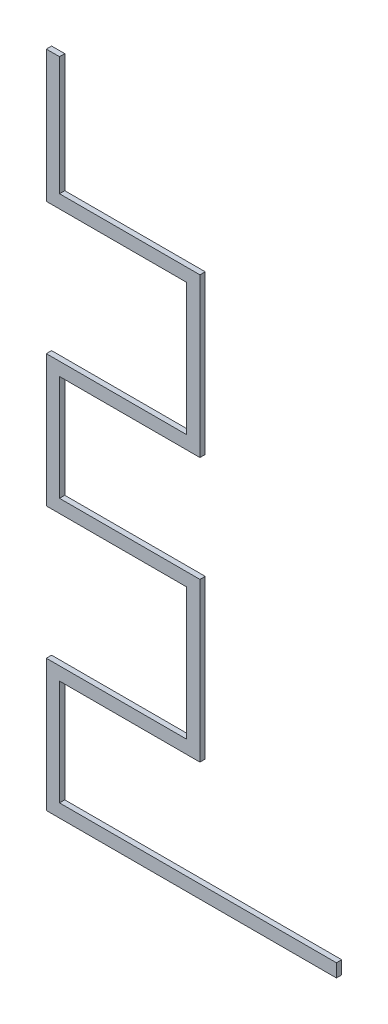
ISO-10303-21;
HEADER;
FILE_DESCRIPTION(('STEP AP214'),'2;1');
FILE_NAME('part.step','',(''),(''),'','','');
FILE_SCHEMA(('AUTOMOTIVE_DESIGN { 1 0 10303 214 1 1 1 1 }'));
ENDSEC;
DATA;
#1=APPLICATION_CONTEXT('core data for automotive mechanical design processes');
#2=APPLICATION_PROTOCOL_DEFINITION('international standard','automotive_design',2000,#1);
#3=PRODUCT_CONTEXT('',#1,'mechanical');
#4=PRODUCT('Part','Part','',(#3));
#5=PRODUCT_RELATED_PRODUCT_CATEGORY('part','',(#4));
#6=PRODUCT_DEFINITION_FORMATION('','',#4);
#7=PRODUCT_DEFINITION_CONTEXT('part definition',#1,'design');
#8=PRODUCT_DEFINITION('design','',#6,#7);
#9=PRODUCT_DEFINITION_SHAPE('','',#8);
#10=(LENGTH_UNIT() NAMED_UNIT(*) SI_UNIT(.MILLI.,.METRE.));
#11=(NAMED_UNIT(*) PLANE_ANGLE_UNIT() SI_UNIT($,.RADIAN.));
#12=(NAMED_UNIT(*) SI_UNIT($,.STERADIAN.) SOLID_ANGLE_UNIT());
#13=UNCERTAINTY_MEASURE_WITH_UNIT(LENGTH_MEASURE(1.E-05),#10,'distance_accuracy_value','');
#14=(GEOMETRIC_REPRESENTATION_CONTEXT(3) GLOBAL_UNCERTAINTY_ASSIGNED_CONTEXT((#13)) GLOBAL_UNIT_ASSIGNED_CONTEXT((#10,
#11,#12)) REPRESENTATION_CONTEXT('',''));
#15=CARTESIAN_POINT('',(0.,0.,0.));
#16=DIRECTION('',(0.,0.,1.));
#17=DIRECTION('',(1.,0.,0.));
#18=AXIS2_PLACEMENT_3D('',#15,#16,#17);
#19=CARTESIAN_POINT('',(-1.00468987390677,-0.331723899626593,0.1));
#20=DIRECTION('',(0.,0.,1.));
#21=DIRECTION('',(1.,0.,0.));
#22=AXIS2_PLACEMENT_3D('',#19,#20,#21);
#23=PLANE('',#22);
#24=DIRECTION('',(0.,1.,0.));
#25=VECTOR('',#24,1.);
#26=CARTESIAN_POINT('',(-2.66251623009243,-2.95934424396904,0.1));
#27=LINE('',#26,#25);
#28=CARTESIAN_POINT('',(-2.66251623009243,-5.45934424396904,0.1));
#29=VERTEX_POINT('',#28);
#30=CARTESIAN_POINT('',(-2.66251623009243,-2.95934424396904,0.1));
#31=VERTEX_POINT('',#30);
#32=EDGE_CURVE('E254',#29,#31,#27,.T.);
#33=ORIENTED_EDGE('',*,*,#32,.F.);
#34=DIRECTION('',(1.,0.,0.));
#35=VECTOR('',#34,1.);
#36=CARTESIAN_POINT('',(-2.66251623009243,-5.45934424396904,0.1));
#37=LINE('',#36,#35);
#38=CARTESIAN_POINT('',(2.83748376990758,-5.45934424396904,0.1));
#39=VERTEX_POINT('',#38);
#40=EDGE_CURVE('E258',#39,#29,#37,.F.);
#41=ORIENTED_EDGE('',*,*,#40,.F.);
#42=DIRECTION('',(0.,1.,0.));
#43=VECTOR('',#42,1.);
#44=CARTESIAN_POINT('',(2.83748376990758,-0.331723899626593,0.1));
#45=LINE('',#44,#43);
#46=CARTESIAN_POINT('',(2.83748376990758,-5.20934424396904,0.1));
#47=VERTEX_POINT('',#46);
#48=EDGE_CURVE('E104',#39,#47,#45,.T.);
#49=ORIENTED_EDGE('',*,*,#48,.T.);
#50=DIRECTION('',(-1.,4.49841222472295E-12,0.));
#51=VECTOR('',#50,1.);
#52=CARTESIAN_POINT('',(2.83748376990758,-5.20934424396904,0.1));
#53=LINE('',#52,#51);
#54=CARTESIAN_POINT('',(-2.41251623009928,-5.20934424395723,0.1));
#55=VERTEX_POINT('',#54);
#56=EDGE_CURVE('E178',#55,#47,#53,.F.);
#57=ORIENTED_EDGE('',*,*,#56,.F.);
#58=DIRECTION('',(0.,1.,0.));
#59=VECTOR('',#58,1.);
#60=CARTESIAN_POINT('',(-2.41251623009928,-5.20934424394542,0.1));
#61=LINE('',#60,#59);
#62=CARTESIAN_POINT('',(-2.41251623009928,-3.20934424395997,0.1));
#63=VERTEX_POINT('',#62);
#64=EDGE_CURVE('E169',#63,#55,#61,.F.);
#65=ORIENTED_EDGE('',*,*,#64,.F.);
#66=DIRECTION('',(1.,0.,0.));
#67=VECTOR('',#66,1.);
#68=CARTESIAN_POINT('',(-2.41251623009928,-3.20934424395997,0.1));
#69=LINE('',#68,#67);
#70=CARTESIAN_POINT('',(0.249999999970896,-3.20934424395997,0.1));
#71=VERTEX_POINT('',#70);
#72=EDGE_CURVE('E185',#71,#63,#69,.F.);
#73=ORIENTED_EDGE('',*,*,#72,.F.);
#74=DIRECTION('',(0.,1.,0.));
#75=VECTOR('',#74,1.);
#76=CARTESIAN_POINT('',(0.249999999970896,-3.20934424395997,0.1));
#77=LINE('',#76,#75);
#78=CARTESIAN_POINT('',(0.249999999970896,-0.209344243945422,0.1));
#79=VERTEX_POINT('',#78);
#80=EDGE_CURVE('E190',#79,#71,#77,.F.);
#81=ORIENTED_EDGE('',*,*,#80,.F.);
#82=DIRECTION('',(-1.,0.,0.));
#83=VECTOR('',#82,1.);
#84=CARTESIAN_POINT('',(0.249999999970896,-0.209344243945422,0.1));
#85=LINE('',#84,#83);
#86=CARTESIAN_POINT('',(-2.41251623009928,-0.209344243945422,0.1));
#87=VERTEX_POINT('',#86);
#88=EDGE_CURVE('E194',#87,#79,#85,.F.);
#89=ORIENTED_EDGE('',*,*,#88,.F.);
#90=DIRECTION('',(0.,1.,0.));
#91=VECTOR('',#90,1.);
#92=CARTESIAN_POINT('',(-2.41251623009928,-0.209344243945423,0.1));
#93=LINE('',#92,#91);
#94=CARTESIAN_POINT('',(-2.41251623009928,1.79065575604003,0.1));
#95=VERTEX_POINT('',#94);
#96=EDGE_CURVE('E198',#95,#87,#93,.F.);
#97=ORIENTED_EDGE('',*,*,#96,.F.);
#98=DIRECTION('',(1.,0.,0.));
#99=VECTOR('',#98,1.);
#100=CARTESIAN_POINT('',(-2.41251623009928,1.79065575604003,0.1));
#101=LINE('',#100,#99);
#102=CARTESIAN_POINT('',(0.249999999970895,1.79065575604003,0.1));
#103=VERTEX_POINT('',#102);
#104=EDGE_CURVE('E202',#103,#95,#101,.F.);
#105=ORIENTED_EDGE('',*,*,#104,.F.);
#106=DIRECTION('',(0.,1.,0.));
#107=VECTOR('',#106,1.);
#108=CARTESIAN_POINT('',(0.249999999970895,1.79065575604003,0.1));
#109=LINE('',#108,#107);
#110=CARTESIAN_POINT('',(0.249999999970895,4.79065575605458,0.1));
#111=VERTEX_POINT('',#110);
#112=EDGE_CURVE('E206',#111,#103,#109,.F.);
#113=ORIENTED_EDGE('',*,*,#112,.F.);
#114=DIRECTION('',(-1.,0.,0.));
#115=VECTOR('',#114,1.);
#116=CARTESIAN_POINT('',(0.249999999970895,4.79065575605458,0.1));
#117=LINE('',#116,#115);
#118=CARTESIAN_POINT('',(-2.41251623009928,4.79065575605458,0.1));
#119=VERTEX_POINT('',#118);
#120=EDGE_CURVE('E210',#119,#111,#117,.F.);
#121=ORIENTED_EDGE('',*,*,#120,.F.);
#122=DIRECTION('',(3.04188772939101E-12,1.,0.));
#123=VECTOR('',#122,1.);
#124=CARTESIAN_POINT('',(-2.41251623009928,4.79065575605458,0.1));
#125=LINE('',#124,#123);
#126=CARTESIAN_POINT('',(-2.41251623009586,7.04065575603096,0.1));
#127=VERTEX_POINT('',#126);
#128=EDGE_CURVE('E214',#127,#119,#125,.F.);
#129=ORIENTED_EDGE('',*,*,#128,.F.);
#130=DIRECTION('',(1.,0.,0.));
#131=VECTOR('',#130,1.);
#132=CARTESIAN_POINT('',(-2.41251623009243,7.04065575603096,0.1));
#133=LINE('',#132,#131);
#134=CARTESIAN_POINT('',(-2.66251623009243,7.04065575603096,0.1));
#135=VERTEX_POINT('',#134);
#136=EDGE_CURVE('E218',#135,#127,#133,.T.);
#137=ORIENTED_EDGE('',*,*,#136,.F.);
#138=DIRECTION('',(0.,-1.,0.));
#139=VECTOR('',#138,1.);
#140=CARTESIAN_POINT('',(-2.66251623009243,7.04065575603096,0.1));
#141=LINE('',#140,#139);
#142=CARTESIAN_POINT('',(-2.66251623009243,4.54065575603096,0.1));
#143=VERTEX_POINT('',#142);
#144=EDGE_CURVE('E222',#143,#135,#141,.F.);
#145=ORIENTED_EDGE('',*,*,#144,.F.);
#146=DIRECTION('',(1.,0.,0.));
#147=VECTOR('',#146,1.);
#148=CARTESIAN_POINT('',(-2.66251623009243,4.54065575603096,0.1));
#149=LINE('',#148,#147);
#150=CARTESIAN_POINT('',(0.,4.54065575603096,0.1));
#151=VERTEX_POINT('',#150);
#152=EDGE_CURVE('E226',#151,#143,#149,.F.);
#153=ORIENTED_EDGE('',*,*,#152,.F.);
#154=DIRECTION('',(0.,-1.,0.));
#155=VECTOR('',#154,1.);
#156=CARTESIAN_POINT('',(0.,4.54065575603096,0.1));
#157=LINE('',#156,#155);
#158=CARTESIAN_POINT('',(0.,2.04065575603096,0.1));
#159=VERTEX_POINT('',#158);
#160=EDGE_CURVE('E230',#159,#151,#157,.F.);
#161=ORIENTED_EDGE('',*,*,#160,.F.);
#162=DIRECTION('',(-1.,0.,0.));
#163=VECTOR('',#162,1.);
#164=CARTESIAN_POINT('',(0.,2.04065575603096,0.1));
#165=LINE('',#164,#163);
#166=CARTESIAN_POINT('',(-2.66251623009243,2.04065575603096,0.1));
#167=VERTEX_POINT('',#166);
#168=EDGE_CURVE('E234',#167,#159,#165,.F.);
#169=ORIENTED_EDGE('',*,*,#168,.F.);
#170=DIRECTION('',(0.,1.,0.));
#171=VECTOR('',#170,1.);
#172=CARTESIAN_POINT('',(-2.66251623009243,2.04065575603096,0.1));
#173=LINE('',#172,#171);
#174=CARTESIAN_POINT('',(-2.66251623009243,-0.45934424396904,0.1));
#175=VERTEX_POINT('',#174);
#176=EDGE_CURVE('E238',#175,#167,#173,.T.);
#177=ORIENTED_EDGE('',*,*,#176,.F.);
#178=DIRECTION('',(1.,0.,0.));
#179=VECTOR('',#178,1.);
#180=CARTESIAN_POINT('',(-2.66251623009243,-0.45934424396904,0.1));
#181=LINE('',#180,#179);
#182=CARTESIAN_POINT('',(0.,-0.459344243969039,0.1));
#183=VERTEX_POINT('',#182);
#184=EDGE_CURVE('E242',#183,#175,#181,.F.);
#185=ORIENTED_EDGE('',*,*,#184,.F.);
#186=DIRECTION('',(0.,-1.,0.));
#187=VECTOR('',#186,1.);
#188=CARTESIAN_POINT('',(0.,-0.459344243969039,0.1));
#189=LINE('',#188,#187);
#190=CARTESIAN_POINT('',(0.,-2.95934424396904,0.1));
#191=VERTEX_POINT('',#190);
#192=EDGE_CURVE('E246',#191,#183,#189,.F.);
#193=ORIENTED_EDGE('',*,*,#192,.F.);
#194=DIRECTION('',(-1.,0.,0.));
#195=VECTOR('',#194,1.);
#196=CARTESIAN_POINT('',(0.,-2.95934424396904,0.1));
#197=LINE('',#196,#195);
#198=EDGE_CURVE('E250',#31,#191,#197,.F.);
#199=ORIENTED_EDGE('',*,*,#198,.F.);
#200=EDGE_LOOP('',(#33,#41,#49,#57,#65,#73,#81,#89,#97,#105,#113,#121,#129,#137,#145,#153,#161,
#169,#177,#185,#193,#199));
#201=FACE_BOUND('',#200,.T.);
#202=ADVANCED_FACE('F15',(#201),#23,.T.);
#203=CARTESIAN_POINT('',(2.83748376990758,-5.20934424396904,0.));
#204=DIRECTION('',(4.49841222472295E-12,1.,0.));
#205=DIRECTION('',(-1.,4.49841222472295E-12,0.));
#206=AXIS2_PLACEMENT_3D('',#203,#204,#205);
#207=PLANE('',#206);
#208=ORIENTED_EDGE('',*,*,#56,.T.);
#209=DIRECTION('',(0.,0.,-1.));
#210=VECTOR('',#209,1.);
#211=CARTESIAN_POINT('',(2.83748376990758,-5.20934424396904,0.));
#212=LINE('',#211,#210);
#213=CARTESIAN_POINT('',(2.83748376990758,-5.20934424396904,0.));
#214=VERTEX_POINT('',#213);
#215=EDGE_CURVE('E262',#214,#47,#212,.F.);
#216=ORIENTED_EDGE('',*,*,#215,.F.);
#217=DIRECTION('',(1.,0.,0.));
#218=VECTOR('',#217,1.);
#219=CARTESIAN_POINT('',(-1.00468987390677,-5.20934424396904,0.));
#220=LINE('',#219,#218);
#221=CARTESIAN_POINT('',(-2.41251623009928,-5.20934424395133,0.));
#222=VERTEX_POINT('',#221);
#223=EDGE_CURVE('E19',#214,#222,#220,.F.);
#224=ORIENTED_EDGE('',*,*,#223,.T.);
#225=DIRECTION('',(0.,0.,-1.));
#226=VECTOR('',#225,1.);
#227=CARTESIAN_POINT('',(-2.41251623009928,-5.20934424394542,0.));
#228=LINE('',#227,#226);
#229=EDGE_CURVE('E174',#55,#222,#228,.T.);
#230=ORIENTED_EDGE('',*,*,#229,.F.);
#231=EDGE_LOOP('',(#208,#216,#224,#230));
#232=FACE_BOUND('',#231,.T.);
#233=ADVANCED_FACE('F184',(#232),#207,.T.);
#234=CARTESIAN_POINT('',(-2.41251623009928,-5.20934424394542,0.));
#235=DIRECTION('',(1.,0.,0.));
#236=DIRECTION('',(0.,0.,-1.));
#237=AXIS2_PLACEMENT_3D('',#234,#235,#236);
#238=PLANE('',#237);
#239=ORIENTED_EDGE('',*,*,#64,.T.);
#240=ORIENTED_EDGE('',*,*,#229,.T.);
#241=DIRECTION('',(0.,1.,0.));
#242=VECTOR('',#241,1.);
#243=CARTESIAN_POINT('',(-2.41251623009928,-0.331723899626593,0.));
#244=LINE('',#243,#242);
#245=CARTESIAN_POINT('',(-2.41251623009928,-3.20934424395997,0.));
#246=VERTEX_POINT('',#245);
#247=EDGE_CURVE('E321',#222,#246,#244,.T.);
#248=ORIENTED_EDGE('',*,*,#247,.T.);
#249=DIRECTION('',(0.,0.,-1.));
#250=VECTOR('',#249,1.);
#251=CARTESIAN_POINT('',(-2.41251623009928,-3.20934424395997,0.));
#252=LINE('',#251,#250);
#253=EDGE_CURVE('E175',#63,#246,#252,.T.);
#254=ORIENTED_EDGE('',*,*,#253,.F.);
#255=EDGE_LOOP('',(#239,#240,#248,#254));
#256=FACE_BOUND('',#255,.T.);
#257=ADVANCED_FACE('F171',(#256),#238,.T.);
#258=CARTESIAN_POINT('',(-2.41251623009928,-3.20934424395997,0.));
#259=DIRECTION('',(0.,-1.,0.));
#260=DIRECTION('',(0.,0.,-1.));
#261=AXIS2_PLACEMENT_3D('',#258,#259,#260);
#262=PLANE('',#261);
#263=ORIENTED_EDGE('',*,*,#72,.T.);
#264=ORIENTED_EDGE('',*,*,#253,.T.);
#265=DIRECTION('',(1.,0.,0.));
#266=VECTOR('',#265,1.);
#267=CARTESIAN_POINT('',(-1.00468987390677,-3.20934424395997,0.));
#268=LINE('',#267,#266);
#269=CARTESIAN_POINT('',(0.249999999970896,-3.20934424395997,0.));
#270=VERTEX_POINT('',#269);
#271=EDGE_CURVE('E319',#246,#270,#268,.T.);
#272=ORIENTED_EDGE('',*,*,#271,.T.);
#273=DIRECTION('',(0.,0.,1.));
#274=VECTOR('',#273,1.);
#275=CARTESIAN_POINT('',(0.249999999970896,-3.20934424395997,0.));
#276=LINE('',#275,#274);
#277=EDGE_CURVE('E192',#71,#270,#276,.F.);
#278=ORIENTED_EDGE('',*,*,#277,.F.);
#279=EDGE_LOOP('',(#263,#264,#272,#278));
#280=FACE_BOUND('',#279,.T.);
#281=ADVANCED_FACE('F328',(#280),#262,.T.);
#282=CARTESIAN_POINT('',(0.249999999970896,-3.20934424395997,0.));
#283=DIRECTION('',(1.,0.,0.));
#284=DIRECTION('',(0.,1.,0.));
#285=AXIS2_PLACEMENT_3D('',#282,#283,#284);
#286=PLANE('',#285);
#287=ORIENTED_EDGE('',*,*,#80,.T.);
#288=ORIENTED_EDGE('',*,*,#277,.T.);
#289=DIRECTION('',(0.,1.,0.));
#290=VECTOR('',#289,1.);
#291=CARTESIAN_POINT('',(0.249999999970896,-0.331723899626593,0.));
#292=LINE('',#291,#290);
#293=CARTESIAN_POINT('',(0.249999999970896,-0.209344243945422,0.));
#294=VERTEX_POINT('',#293);
#295=EDGE_CURVE('E316',#270,#294,#292,.T.);
#296=ORIENTED_EDGE('',*,*,#295,.T.);
#297=DIRECTION('',(0.,0.,1.));
#298=VECTOR('',#297,1.);
#299=CARTESIAN_POINT('',(0.249999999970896,-0.209344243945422,0.));
#300=LINE('',#299,#298);
#301=EDGE_CURVE('E196',#79,#294,#300,.F.);
#302=ORIENTED_EDGE('',*,*,#301,.F.);
#303=EDGE_LOOP('',(#287,#288,#296,#302));
#304=FACE_BOUND('',#303,.T.);
#305=ADVANCED_FACE('F335',(#304),#286,.T.);
#306=CARTESIAN_POINT('',(0.249999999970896,-0.209344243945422,0.));
#307=DIRECTION('',(0.,1.,0.));
#308=DIRECTION('',(-1.,0.,0.));
#309=AXIS2_PLACEMENT_3D('',#306,#307,#308);
#310=PLANE('',#309);
#311=ORIENTED_EDGE('',*,*,#88,.T.);
#312=ORIENTED_EDGE('',*,*,#301,.T.);
#313=DIRECTION('',(1.,0.,0.));
#314=VECTOR('',#313,1.);
#315=CARTESIAN_POINT('',(-1.00468987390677,-0.209344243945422,0.));
#316=LINE('',#315,#314);
#317=CARTESIAN_POINT('',(-2.41251623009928,-0.209344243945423,0.));
#318=VERTEX_POINT('',#317);
#319=EDGE_CURVE('E313',#294,#318,#316,.F.);
#320=ORIENTED_EDGE('',*,*,#319,.T.);
#321=DIRECTION('',(0.,0.,-1.));
#322=VECTOR('',#321,1.);
#323=CARTESIAN_POINT('',(-2.41251623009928,-0.209344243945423,0.));
#324=LINE('',#323,#322);
#325=EDGE_CURVE('E200',#87,#318,#324,.T.);
#326=ORIENTED_EDGE('',*,*,#325,.F.);
#327=EDGE_LOOP('',(#311,#312,#320,#326));
#328=FACE_BOUND('',#327,.T.);
#329=ADVANCED_FACE('F337',(#328),#310,.T.);
#330=CARTESIAN_POINT('',(-2.41251623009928,-0.209344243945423,0.));
#331=DIRECTION('',(1.,0.,0.));
#332=DIRECTION('',(0.,0.,-1.));
#333=AXIS2_PLACEMENT_3D('',#330,#331,#332);
#334=PLANE('',#333);
#335=ORIENTED_EDGE('',*,*,#96,.T.);
#336=ORIENTED_EDGE('',*,*,#325,.T.);
#337=DIRECTION('',(0.,1.,0.));
#338=VECTOR('',#337,1.);
#339=CARTESIAN_POINT('',(-2.41251623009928,-0.331723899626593,0.));
#340=LINE('',#339,#338);
#341=CARTESIAN_POINT('',(-2.41251623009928,1.79065575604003,0.));
#342=VERTEX_POINT('',#341);
#343=EDGE_CURVE('E310',#318,#342,#340,.T.);
#344=ORIENTED_EDGE('',*,*,#343,.T.);
#345=DIRECTION('',(0.,0.,-1.));
#346=VECTOR('',#345,1.);
#347=CARTESIAN_POINT('',(-2.41251623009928,1.79065575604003,0.));
#348=LINE('',#347,#346);
#349=EDGE_CURVE('E204',#95,#342,#348,.T.);
#350=ORIENTED_EDGE('',*,*,#349,.F.);
#351=EDGE_LOOP('',(#335,#336,#344,#350));
#352=FACE_BOUND('',#351,.T.);
#353=ADVANCED_FACE('F343',(#352),#334,.T.);
#354=CARTESIAN_POINT('',(-2.41251623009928,1.79065575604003,0.));
#355=DIRECTION('',(0.,-1.,0.));
#356=DIRECTION('',(0.,0.,-1.));
#357=AXIS2_PLACEMENT_3D('',#354,#355,#356);
#358=PLANE('',#357);
#359=ORIENTED_EDGE('',*,*,#104,.T.);
#360=ORIENTED_EDGE('',*,*,#349,.T.);
#361=DIRECTION('',(1.,0.,0.));
#362=VECTOR('',#361,1.);
#363=CARTESIAN_POINT('',(-1.00468987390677,1.79065575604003,0.));
#364=LINE('',#363,#362);
#365=CARTESIAN_POINT('',(0.249999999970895,1.79065575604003,0.));
#366=VERTEX_POINT('',#365);
#367=EDGE_CURVE('E307',#342,#366,#364,.T.);
#368=ORIENTED_EDGE('',*,*,#367,.T.);
#369=DIRECTION('',(0.,0.,1.));
#370=VECTOR('',#369,1.);
#371=CARTESIAN_POINT('',(0.249999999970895,1.79065575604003,0.));
#372=LINE('',#371,#370);
#373=EDGE_CURVE('E208',#103,#366,#372,.F.);
#374=ORIENTED_EDGE('',*,*,#373,.F.);
#375=EDGE_LOOP('',(#359,#360,#368,#374));
#376=FACE_BOUND('',#375,.T.);
#377=ADVANCED_FACE('F350',(#376),#358,.T.);
#378=CARTESIAN_POINT('',(0.249999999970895,1.79065575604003,0.));
#379=DIRECTION('',(1.,0.,0.));
#380=DIRECTION('',(0.,1.,0.));
#381=AXIS2_PLACEMENT_3D('',#378,#379,#380);
#382=PLANE('',#381);
#383=ORIENTED_EDGE('',*,*,#112,.T.);
#384=ORIENTED_EDGE('',*,*,#373,.T.);
#385=DIRECTION('',(0.,1.,0.));
#386=VECTOR('',#385,1.);
#387=CARTESIAN_POINT('',(0.249999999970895,-0.331723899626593,0.));
#388=LINE('',#387,#386);
#389=CARTESIAN_POINT('',(0.249999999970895,4.79065575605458,0.));
#390=VERTEX_POINT('',#389);
#391=EDGE_CURVE('E304',#366,#390,#388,.T.);
#392=ORIENTED_EDGE('',*,*,#391,.T.);
#393=DIRECTION('',(0.,0.,1.));
#394=VECTOR('',#393,1.);
#395=CARTESIAN_POINT('',(0.249999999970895,4.79065575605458,0.));
#396=LINE('',#395,#394);
#397=EDGE_CURVE('E212',#111,#390,#396,.F.);
#398=ORIENTED_EDGE('',*,*,#397,.F.);
#399=EDGE_LOOP('',(#383,#384,#392,#398));
#400=FACE_BOUND('',#399,.T.);
#401=ADVANCED_FACE('F352',(#400),#382,.T.);
#402=CARTESIAN_POINT('',(0.249999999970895,4.79065575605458,0.));
#403=DIRECTION('',(0.,1.,0.));
#404=DIRECTION('',(-1.,0.,0.));
#405=AXIS2_PLACEMENT_3D('',#402,#403,#404);
#406=PLANE('',#405);
#407=ORIENTED_EDGE('',*,*,#120,.T.);
#408=ORIENTED_EDGE('',*,*,#397,.T.);
#409=DIRECTION('',(1.,0.,0.));
#410=VECTOR('',#409,1.);
#411=CARTESIAN_POINT('',(-1.00468987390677,4.79065575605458,0.));
#412=LINE('',#411,#410);
#413=CARTESIAN_POINT('',(-2.41251623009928,4.79065575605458,0.));
#414=VERTEX_POINT('',#413);
#415=EDGE_CURVE('E301',#390,#414,#412,.F.);
#416=ORIENTED_EDGE('',*,*,#415,.T.);
#417=DIRECTION('',(0.,0.,1.));
#418=VECTOR('',#417,1.);
#419=CARTESIAN_POINT('',(-2.41251623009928,4.79065575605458,0.));
#420=LINE('',#419,#418);
#421=EDGE_CURVE('E216',#119,#414,#420,.F.);
#422=ORIENTED_EDGE('',*,*,#421,.F.);
#423=EDGE_LOOP('',(#407,#408,#416,#422));
#424=FACE_BOUND('',#423,.T.);
#425=ADVANCED_FACE('F358',(#424),#406,.T.);
#426=CARTESIAN_POINT('',(-2.41251623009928,4.79065575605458,0.));
#427=DIRECTION('',(1.,-3.04188772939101E-12,0.));
#428=DIRECTION('',(3.04188772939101E-12,1.,0.));
#429=AXIS2_PLACEMENT_3D('',#426,#427,#428);
#430=PLANE('',#429);
#431=ORIENTED_EDGE('',*,*,#128,.T.);
#432=ORIENTED_EDGE('',*,*,#421,.T.);
#433=DIRECTION('',(0.,1.,0.));
#434=VECTOR('',#433,1.);
#435=CARTESIAN_POINT('',(-2.41251623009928,-0.331723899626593,0.));
#436=LINE('',#435,#434);
#437=CARTESIAN_POINT('',(-2.41251623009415,7.04065575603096,0.));
#438=VERTEX_POINT('',#437);
#439=EDGE_CURVE('E298',#414,#438,#436,.T.);
#440=ORIENTED_EDGE('',*,*,#439,.T.);
#441=DIRECTION('',(0.,0.,1.));
#442=VECTOR('',#441,1.);
#443=CARTESIAN_POINT('',(-2.41251623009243,7.04065575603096,0.));
#444=LINE('',#443,#442);
#445=EDGE_CURVE('E220',#127,#438,#444,.F.);
#446=ORIENTED_EDGE('',*,*,#445,.F.);
#447=EDGE_LOOP('',(#431,#432,#440,#446));
#448=FACE_BOUND('',#447,.T.);
#449=ADVANCED_FACE('F365',(#448),#430,.T.);
#450=CARTESIAN_POINT('',(-2.41251623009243,7.04065575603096,0.));
#451=DIRECTION('',(0.,1.,0.));
#452=DIRECTION('',(0.,0.,1.));
#453=AXIS2_PLACEMENT_3D('',#450,#451,#452);
#454=PLANE('',#453);
#455=ORIENTED_EDGE('',*,*,#136,.T.);
#456=ORIENTED_EDGE('',*,*,#445,.T.);
#457=DIRECTION('',(1.,0.,0.));
#458=VECTOR('',#457,1.);
#459=CARTESIAN_POINT('',(-1.00468987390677,7.04065575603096,0.));
#460=LINE('',#459,#458);
#461=CARTESIAN_POINT('',(-2.66251623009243,7.04065575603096,0.));
#462=VERTEX_POINT('',#461);
#463=EDGE_CURVE('E295',#438,#462,#460,.F.);
#464=ORIENTED_EDGE('',*,*,#463,.T.);
#465=DIRECTION('',(0.,0.,1.));
#466=VECTOR('',#465,1.);
#467=CARTESIAN_POINT('',(-2.66251623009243,7.04065575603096,0.));
#468=LINE('',#467,#466);
#469=EDGE_CURVE('E224',#135,#462,#468,.F.);
#470=ORIENTED_EDGE('',*,*,#469,.F.);
#471=EDGE_LOOP('',(#455,#456,#464,#470));
#472=FACE_BOUND('',#471,.T.);
#473=ADVANCED_FACE('F367',(#472),#454,.T.);
#474=CARTESIAN_POINT('',(-2.66251623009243,7.04065575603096,0.));
#475=DIRECTION('',(-1.,0.,0.));
#476=DIRECTION('',(0.,-1.,0.));
#477=AXIS2_PLACEMENT_3D('',#474,#475,#476);
#478=PLANE('',#477);
#479=ORIENTED_EDGE('',*,*,#144,.T.);
#480=ORIENTED_EDGE('',*,*,#469,.T.);
#481=DIRECTION('',(0.,1.,0.));
#482=VECTOR('',#481,1.);
#483=CARTESIAN_POINT('',(-2.66251623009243,-0.331723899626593,0.));
#484=LINE('',#483,#482);
#485=CARTESIAN_POINT('',(-2.66251623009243,4.54065575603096,0.));
#486=VERTEX_POINT('',#485);
#487=EDGE_CURVE('E292',#462,#486,#484,.F.);
#488=ORIENTED_EDGE('',*,*,#487,.T.);
#489=DIRECTION('',(0.,0.,1.));
#490=VECTOR('',#489,1.);
#491=CARTESIAN_POINT('',(-2.66251623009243,4.54065575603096,0.));
#492=LINE('',#491,#490);
#493=EDGE_CURVE('E228',#143,#486,#492,.F.);
#494=ORIENTED_EDGE('',*,*,#493,.F.);
#495=EDGE_LOOP('',(#479,#480,#488,#494));
#496=FACE_BOUND('',#495,.T.);
#497=ADVANCED_FACE('F373',(#496),#478,.T.);
#498=CARTESIAN_POINT('',(-2.66251623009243,4.54065575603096,0.));
#499=DIRECTION('',(0.,-1.,0.));
#500=DIRECTION('',(1.,0.,0.));
#501=AXIS2_PLACEMENT_3D('',#498,#499,#500);
#502=PLANE('',#501);
#503=ORIENTED_EDGE('',*,*,#152,.T.);
#504=ORIENTED_EDGE('',*,*,#493,.T.);
#505=DIRECTION('',(1.,0.,0.));
#506=VECTOR('',#505,1.);
#507=CARTESIAN_POINT('',(-1.00468987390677,4.54065575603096,0.));
#508=LINE('',#507,#506);
#509=CARTESIAN_POINT('',(0.,4.54065575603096,0.));
#510=VERTEX_POINT('',#509);
#511=EDGE_CURVE('E289',#486,#510,#508,.T.);
#512=ORIENTED_EDGE('',*,*,#511,.T.);
#513=DIRECTION('',(0.,0.,1.));
#514=VECTOR('',#513,1.);
#515=CARTESIAN_POINT('',(0.,4.54065575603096,0.));
#516=LINE('',#515,#514);
#517=EDGE_CURVE('E232',#151,#510,#516,.F.);
#518=ORIENTED_EDGE('',*,*,#517,.F.);
#519=EDGE_LOOP('',(#503,#504,#512,#518));
#520=FACE_BOUND('',#519,.T.);
#521=ADVANCED_FACE('F380',(#520),#502,.T.);
#522=CARTESIAN_POINT('',(0.,4.54065575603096,0.));
#523=DIRECTION('',(-1.,0.,0.));
#524=DIRECTION('',(0.,-1.,0.));
#525=AXIS2_PLACEMENT_3D('',#522,#523,#524);
#526=PLANE('',#525);
#527=ORIENTED_EDGE('',*,*,#160,.T.);
#528=ORIENTED_EDGE('',*,*,#517,.T.);
#529=DIRECTION('',(0.,1.,0.));
#530=VECTOR('',#529,1.);
#531=CARTESIAN_POINT('',(0.,-0.331723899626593,0.));
#532=LINE('',#531,#530);
#533=CARTESIAN_POINT('',(0.,2.04065575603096,0.));
#534=VERTEX_POINT('',#533);
#535=EDGE_CURVE('E286',#510,#534,#532,.F.);
#536=ORIENTED_EDGE('',*,*,#535,.T.);
#537=DIRECTION('',(0.,0.,1.));
#538=VECTOR('',#537,1.);
#539=CARTESIAN_POINT('',(0.,2.04065575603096,0.));
#540=LINE('',#539,#538);
#541=EDGE_CURVE('E236',#159,#534,#540,.F.);
#542=ORIENTED_EDGE('',*,*,#541,.F.);
#543=EDGE_LOOP('',(#527,#528,#536,#542));
#544=FACE_BOUND('',#543,.T.);
#545=ADVANCED_FACE('F382',(#544),#526,.T.);
#546=CARTESIAN_POINT('',(0.,2.04065575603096,0.));
#547=DIRECTION('',(0.,1.,0.));
#548=DIRECTION('',(-1.,0.,0.));
#549=AXIS2_PLACEMENT_3D('',#546,#547,#548);
#550=PLANE('',#549);
#551=ORIENTED_EDGE('',*,*,#168,.T.);
#552=ORIENTED_EDGE('',*,*,#541,.T.);
#553=DIRECTION('',(1.,0.,0.));
#554=VECTOR('',#553,1.);
#555=CARTESIAN_POINT('',(-1.00468987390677,2.04065575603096,0.));
#556=LINE('',#555,#554);
#557=CARTESIAN_POINT('',(-2.66251623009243,2.04065575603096,0.));
#558=VERTEX_POINT('',#557);
#559=EDGE_CURVE('E283',#534,#558,#556,.F.);
#560=ORIENTED_EDGE('',*,*,#559,.T.);
#561=DIRECTION('',(0.,0.,1.));
#562=VECTOR('',#561,1.);
#563=CARTESIAN_POINT('',(-2.66251623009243,2.04065575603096,0.));
#564=LINE('',#563,#562);
#565=EDGE_CURVE('E240',#167,#558,#564,.F.);
#566=ORIENTED_EDGE('',*,*,#565,.F.);
#567=EDGE_LOOP('',(#551,#552,#560,#566));
#568=FACE_BOUND('',#567,.T.);
#569=ADVANCED_FACE('F388',(#568),#550,.T.);
#570=CARTESIAN_POINT('',(-2.66251623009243,2.04065575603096,0.));
#571=DIRECTION('',(-1.,0.,0.));
#572=DIRECTION('',(0.,0.,1.));
#573=AXIS2_PLACEMENT_3D('',#570,#571,#572);
#574=PLANE('',#573);
#575=ORIENTED_EDGE('',*,*,#176,.T.);
#576=ORIENTED_EDGE('',*,*,#565,.T.);
#577=DIRECTION('',(0.,1.,0.));
#578=VECTOR('',#577,1.);
#579=CARTESIAN_POINT('',(-2.66251623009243,-0.331723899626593,0.));
#580=LINE('',#579,#578);
#581=CARTESIAN_POINT('',(-2.66251623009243,-0.45934424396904,0.));
#582=VERTEX_POINT('',#581);
#583=EDGE_CURVE('E280',#558,#582,#580,.F.);
#584=ORIENTED_EDGE('',*,*,#583,.T.);
#585=DIRECTION('',(0.,0.,1.));
#586=VECTOR('',#585,1.);
#587=CARTESIAN_POINT('',(-2.66251623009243,-0.45934424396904,0.));
#588=LINE('',#587,#586);
#589=EDGE_CURVE('E244',#175,#582,#588,.F.);
#590=ORIENTED_EDGE('',*,*,#589,.F.);
#591=EDGE_LOOP('',(#575,#576,#584,#590));
#592=FACE_BOUND('',#591,.T.);
#593=ADVANCED_FACE('F395',(#592),#574,.T.);
#594=CARTESIAN_POINT('',(-2.66251623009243,-0.45934424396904,0.));
#595=DIRECTION('',(0.,-1.,0.));
#596=DIRECTION('',(1.,0.,0.));
#597=AXIS2_PLACEMENT_3D('',#594,#595,#596);
#598=PLANE('',#597);
#599=ORIENTED_EDGE('',*,*,#184,.T.);
#600=ORIENTED_EDGE('',*,*,#589,.T.);
#601=DIRECTION('',(1.,0.,0.));
#602=VECTOR('',#601,1.);
#603=CARTESIAN_POINT('',(-1.00468987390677,-0.45934424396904,0.));
#604=LINE('',#603,#602);
#605=CARTESIAN_POINT('',(0.,-0.459344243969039,0.));
#606=VERTEX_POINT('',#605);
#607=EDGE_CURVE('E277',#582,#606,#604,.T.);
#608=ORIENTED_EDGE('',*,*,#607,.T.);
#609=DIRECTION('',(0.,0.,1.));
#610=VECTOR('',#609,1.);
#611=CARTESIAN_POINT('',(0.,-0.459344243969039,0.));
#612=LINE('',#611,#610);
#613=EDGE_CURVE('E248',#183,#606,#612,.F.);
#614=ORIENTED_EDGE('',*,*,#613,.F.);
#615=EDGE_LOOP('',(#599,#600,#608,#614));
#616=FACE_BOUND('',#615,.T.);
#617=ADVANCED_FACE('F397',(#616),#598,.T.);
#618=CARTESIAN_POINT('',(0.,-0.459344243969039,0.));
#619=DIRECTION('',(-1.,0.,0.));
#620=DIRECTION('',(0.,-1.,0.));
#621=AXIS2_PLACEMENT_3D('',#618,#619,#620);
#622=PLANE('',#621);
#623=ORIENTED_EDGE('',*,*,#192,.T.);
#624=ORIENTED_EDGE('',*,*,#613,.T.);
#625=DIRECTION('',(0.,1.,0.));
#626=VECTOR('',#625,1.);
#627=CARTESIAN_POINT('',(0.,-0.331723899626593,0.));
#628=LINE('',#627,#626);
#629=CARTESIAN_POINT('',(0.,-2.95934424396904,0.));
#630=VERTEX_POINT('',#629);
#631=EDGE_CURVE('E274',#606,#630,#628,.F.);
#632=ORIENTED_EDGE('',*,*,#631,.T.);
#633=DIRECTION('',(0.,0.,1.));
#634=VECTOR('',#633,1.);
#635=CARTESIAN_POINT('',(0.,-2.95934424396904,0.));
#636=LINE('',#635,#634);
#637=EDGE_CURVE('E252',#191,#630,#636,.F.);
#638=ORIENTED_EDGE('',*,*,#637,.F.);
#639=EDGE_LOOP('',(#623,#624,#632,#638));
#640=FACE_BOUND('',#639,.T.);
#641=ADVANCED_FACE('F403',(#640),#622,.T.);
#642=CARTESIAN_POINT('',(0.,-2.95934424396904,0.));
#643=DIRECTION('',(0.,1.,0.));
#644=DIRECTION('',(-1.,0.,0.));
#645=AXIS2_PLACEMENT_3D('',#642,#643,#644);
#646=PLANE('',#645);
#647=ORIENTED_EDGE('',*,*,#198,.T.);
#648=ORIENTED_EDGE('',*,*,#637,.T.);
#649=DIRECTION('',(1.,0.,0.));
#650=VECTOR('',#649,1.);
#651=CARTESIAN_POINT('',(-1.00468987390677,-2.95934424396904,0.));
#652=LINE('',#651,#650);
#653=CARTESIAN_POINT('',(-2.66251623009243,-2.95934424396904,0.));
#654=VERTEX_POINT('',#653);
#655=EDGE_CURVE('E271',#630,#654,#652,.F.);
#656=ORIENTED_EDGE('',*,*,#655,.T.);
#657=DIRECTION('',(0.,0.,1.));
#658=VECTOR('',#657,1.);
#659=CARTESIAN_POINT('',(-2.66251623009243,-2.95934424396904,0.));
#660=LINE('',#659,#658);
#661=EDGE_CURVE('E256',#31,#654,#660,.F.);
#662=ORIENTED_EDGE('',*,*,#661,.F.);
#663=EDGE_LOOP('',(#647,#648,#656,#662));
#664=FACE_BOUND('',#663,.T.);
#665=ADVANCED_FACE('F408',(#664),#646,.T.);
#666=CARTESIAN_POINT('',(-2.66251623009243,-2.95934424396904,0.));
#667=DIRECTION('',(-1.,0.,0.));
#668=DIRECTION('',(0.,0.,1.));
#669=AXIS2_PLACEMENT_3D('',#666,#667,#668);
#670=PLANE('',#669);
#671=ORIENTED_EDGE('',*,*,#32,.T.);
#672=ORIENTED_EDGE('',*,*,#661,.T.);
#673=DIRECTION('',(0.,1.,0.));
#674=VECTOR('',#673,1.);
#675=CARTESIAN_POINT('',(-2.66251623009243,-0.331723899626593,0.));
#676=LINE('',#675,#674);
#677=CARTESIAN_POINT('',(-2.66251623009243,-5.45934424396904,0.));
#678=VERTEX_POINT('',#677);
#679=EDGE_CURVE('E268',#654,#678,#676,.F.);
#680=ORIENTED_EDGE('',*,*,#679,.T.);
#681=DIRECTION('',(0.,0.,1.));
#682=VECTOR('',#681,1.);
#683=CARTESIAN_POINT('',(-2.66251623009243,-5.45934424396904,0.));
#684=LINE('',#683,#682);
#685=EDGE_CURVE('E260',#29,#678,#684,.F.);
#686=ORIENTED_EDGE('',*,*,#685,.F.);
#687=EDGE_LOOP('',(#671,#672,#680,#686));
#688=FACE_BOUND('',#687,.T.);
#689=ADVANCED_FACE('F410',(#688),#670,.T.);
#690=CARTESIAN_POINT('',(-2.66251623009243,-5.45934424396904,0.));
#691=DIRECTION('',(0.,-1.,0.));
#692=DIRECTION('',(1.,0.,0.));
#693=AXIS2_PLACEMENT_3D('',#690,#691,#692);
#694=PLANE('',#693);
#695=ORIENTED_EDGE('',*,*,#40,.T.);
#696=ORIENTED_EDGE('',*,*,#685,.T.);
#697=DIRECTION('',(1.,0.,0.));
#698=VECTOR('',#697,1.);
#699=CARTESIAN_POINT('',(-1.00468987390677,-5.45934424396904,0.));
#700=LINE('',#699,#698);
#701=CARTESIAN_POINT('',(2.83748376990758,-5.45934424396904,0.));
#702=VERTEX_POINT('',#701);
#703=EDGE_CURVE('E25',#678,#702,#700,.T.);
#704=ORIENTED_EDGE('',*,*,#703,.T.);
#705=DIRECTION('',(0.,0.,-1.));
#706=VECTOR('',#705,1.);
#707=CARTESIAN_POINT('',(2.83748376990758,-5.45934424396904,0.));
#708=LINE('',#707,#706);
#709=EDGE_CURVE('E33',#39,#702,#708,.T.);
#710=ORIENTED_EDGE('',*,*,#709,.F.);
#711=EDGE_LOOP('',(#695,#696,#704,#710));
#712=FACE_BOUND('',#711,.T.);
#713=ADVANCED_FACE('F412',(#712),#694,.T.);
#714=CARTESIAN_POINT('',(2.83748376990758,-5.45934424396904,0.));
#715=DIRECTION('',(1.,0.,0.));
#716=DIRECTION('',(0.,0.,-1.));
#717=AXIS2_PLACEMENT_3D('',#714,#715,#716);
#718=PLANE('',#717);
#719=ORIENTED_EDGE('',*,*,#48,.F.);
#720=ORIENTED_EDGE('',*,*,#709,.T.);
#721=DIRECTION('',(0.,1.,0.));
#722=VECTOR('',#721,1.);
#723=CARTESIAN_POINT('',(2.83748376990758,-0.331723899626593,0.));
#724=LINE('',#723,#722);
#725=EDGE_CURVE('E10',#702,#214,#724,.T.);
#726=ORIENTED_EDGE('',*,*,#725,.T.);
#727=ORIENTED_EDGE('',*,*,#215,.T.);
#728=EDGE_LOOP('',(#719,#720,#726,#727));
#729=FACE_BOUND('',#728,.T.);
#730=ADVANCED_FACE('F414',(#729),#718,.T.);
#731=CARTESIAN_POINT('',(-1.00468987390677,-0.331723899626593,0.));
#732=DIRECTION('',(0.,0.,1.));
#733=DIRECTION('',(1.,0.,0.));
#734=AXIS2_PLACEMENT_3D('',#731,#732,#733);
#735=PLANE('',#734);
#736=ORIENTED_EDGE('',*,*,#703,.F.);
#737=ORIENTED_EDGE('',*,*,#679,.F.);
#738=ORIENTED_EDGE('',*,*,#655,.F.);
#739=ORIENTED_EDGE('',*,*,#631,.F.);
#740=ORIENTED_EDGE('',*,*,#607,.F.);
#741=ORIENTED_EDGE('',*,*,#583,.F.);
#742=ORIENTED_EDGE('',*,*,#559,.F.);
#743=ORIENTED_EDGE('',*,*,#535,.F.);
#744=ORIENTED_EDGE('',*,*,#511,.F.);
#745=ORIENTED_EDGE('',*,*,#487,.F.);
#746=ORIENTED_EDGE('',*,*,#463,.F.);
#747=ORIENTED_EDGE('',*,*,#439,.F.);
#748=ORIENTED_EDGE('',*,*,#415,.F.);
#749=ORIENTED_EDGE('',*,*,#391,.F.);
#750=ORIENTED_EDGE('',*,*,#367,.F.);
#751=ORIENTED_EDGE('',*,*,#343,.F.);
#752=ORIENTED_EDGE('',*,*,#319,.F.);
#753=ORIENTED_EDGE('',*,*,#295,.F.);
#754=ORIENTED_EDGE('',*,*,#271,.F.);
#755=ORIENTED_EDGE('',*,*,#247,.F.);
#756=ORIENTED_EDGE('',*,*,#223,.F.);
#757=ORIENTED_EDGE('',*,*,#725,.F.);
#758=EDGE_LOOP('',(#736,#737,#738,#739,#740,#741,#742,#743,#744,#745,#746,#747,#748,#749,#750,
#751,#752,#753,#754,#755,#756,#757));
#759=FACE_BOUND('',#758,.T.);
#760=ADVANCED_FACE('F17',(#759),#735,.F.);
#761=CLOSED_SHELL('',(#202,#233,#257,#281,#305,#329,#353,#377,#401,#425,#449,#473,#497,#521,
#545,#569,#593,#617,#641,#665,#689,#713,#730,#760));
#762=MANIFOLD_SOLID_BREP('B1',#761);
#763=ADVANCED_BREP_SHAPE_REPRESENTATION('',(#18,#762),#14);
#764=SHAPE_DEFINITION_REPRESENTATION(#9,#763);
ENDSEC;
END-ISO-10303-21;
